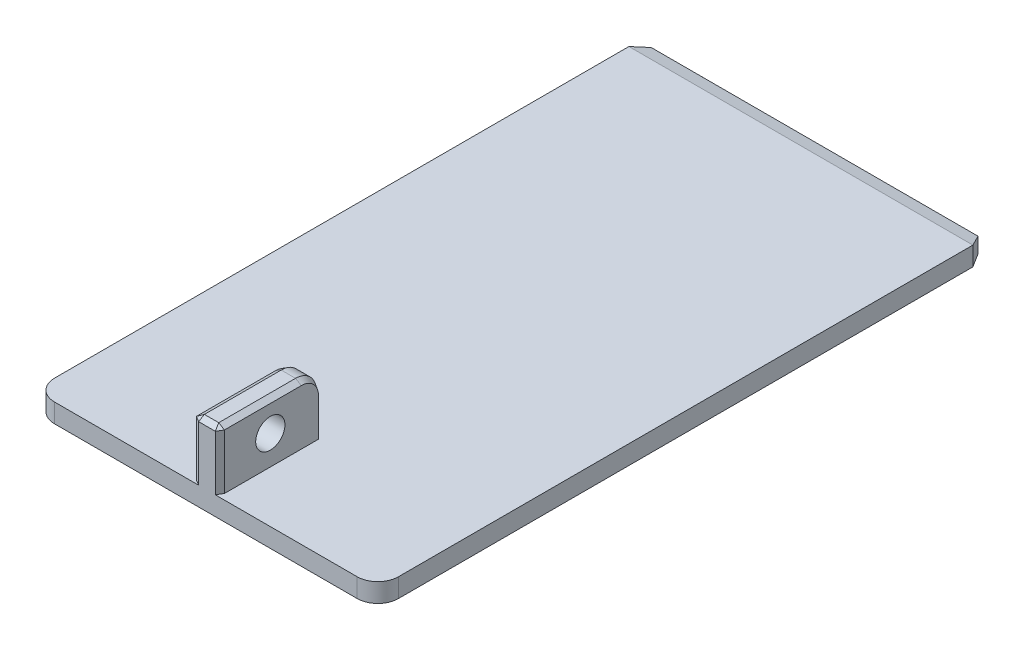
ISO-10303-21;
HEADER;
FILE_DESCRIPTION(('STEP AP214'),'2;1');
FILE_NAME('part.step','',(''),(''),'','','');
FILE_SCHEMA(('AUTOMOTIVE_DESIGN { 1 0 10303 214 1 1 1 1 }'));
ENDSEC;
DATA;
#1=APPLICATION_CONTEXT('core data for automotive mechanical design processes');
#2=APPLICATION_PROTOCOL_DEFINITION('international standard','automotive_design',2000,#1);
#3=PRODUCT_CONTEXT('',#1,'mechanical');
#4=PRODUCT('Part','Part','',(#3));
#5=PRODUCT_RELATED_PRODUCT_CATEGORY('part','',(#4));
#6=PRODUCT_DEFINITION_FORMATION('','',#4);
#7=PRODUCT_DEFINITION_CONTEXT('part definition',#1,'design');
#8=PRODUCT_DEFINITION('design','',#6,#7);
#9=PRODUCT_DEFINITION_SHAPE('','',#8);
#10=(LENGTH_UNIT() NAMED_UNIT(*) SI_UNIT(.MILLI.,.METRE.));
#11=(NAMED_UNIT(*) PLANE_ANGLE_UNIT() SI_UNIT($,.RADIAN.));
#12=(NAMED_UNIT(*) SI_UNIT($,.STERADIAN.) SOLID_ANGLE_UNIT());
#13=UNCERTAINTY_MEASURE_WITH_UNIT(LENGTH_MEASURE(1.E-05),#10,'distance_accuracy_value','');
#14=(GEOMETRIC_REPRESENTATION_CONTEXT(3) GLOBAL_UNCERTAINTY_ASSIGNED_CONTEXT((#13)) GLOBAL_UNIT_ASSIGNED_CONTEXT((#10,
#11,#12)) REPRESENTATION_CONTEXT('',''));
#15=CARTESIAN_POINT('',(0.,0.,0.));
#16=DIRECTION('',(0.,0.,1.));
#17=DIRECTION('',(1.,0.,0.));
#18=AXIS2_PLACEMENT_3D('',#15,#16,#17);
#19=CARTESIAN_POINT('',(-50.,2.75,177.));
#20=DIRECTION('',(0.,-1.,0.));
#21=DIRECTION('',(0.,0.,-1.));
#22=AXIS2_PLACEMENT_3D('',#19,#20,#21);
#23=PLANE('',#22);
#24=DIRECTION('',(0.,0.,-1.));
#25=VECTOR('',#24,1.);
#26=CARTESIAN_POINT('',(-50.,2.75,177.));
#27=LINE('',#26,#25);
#28=CARTESIAN_POINT('',(-50.,2.75,171.));
#29=VERTEX_POINT('',#28);
#30=CARTESIAN_POINT('',(-50.,2.75,4.));
#31=VERTEX_POINT('',#30);
#32=EDGE_CURVE('E179',#29,#31,#27,.T.);
#33=ORIENTED_EDGE('',*,*,#32,.F.);
#34=CARTESIAN_POINT('',(-44.,2.75,171.));
#35=DIRECTION('',(0.,-1.,0.));
#36=DIRECTION('',(0.,0.,-1.));
#37=AXIS2_PLACEMENT_3D('',#34,#35,#36);
#38=CIRCLE('',#37,6.);
#39=CARTESIAN_POINT('',(-44.,2.75,177.));
#40=VERTEX_POINT('',#39);
#41=EDGE_CURVE('E240',#29,#40,#38,.F.);
#42=ORIENTED_EDGE('',*,*,#41,.T.);
#43=DIRECTION('',(-1.,0.,0.));
#44=VECTOR('',#43,1.);
#45=CARTESIAN_POINT('',(-50.,2.75,177.));
#46=LINE('',#45,#44);
#47=CARTESIAN_POINT('',(-2.08572051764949,2.75,177.));
#48=VERTEX_POINT('',#47);
#49=EDGE_CURVE('E336',#48,#40,#46,.T.);
#50=ORIENTED_EDGE('',*,*,#49,.F.);
#51=DIRECTION('',(-0.857167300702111,0.,-0.515038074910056));
#52=VECTOR('',#51,1.);
#53=CARTESIAN_POINT('',(-37.2900560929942,2.75,155.847101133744));
#54=LINE('',#53,#52);
#55=CARTESIAN_POINT('',(-3.75,2.75,176.));
#56=VERTEX_POINT('',#55);
#57=EDGE_CURVE('E11',#48,#56,#54,.T.);
#58=ORIENTED_EDGE('',*,*,#57,.T.);
#59=DIRECTION('',(0.,0.,1.));
#60=VECTOR('',#59,1.);
#61=CARTESIAN_POINT('',(-3.75,2.75,177.));
#62=LINE('',#61,#60);
#63=CARTESIAN_POINT('',(-3.75,2.75,148.));
#64=VERTEX_POINT('',#63);
#65=EDGE_CURVE('E329',#64,#56,#62,.T.);
#66=ORIENTED_EDGE('',*,*,#65,.F.);
#67=DIRECTION('',(-0.857167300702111,0.,0.515038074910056));
#68=VECTOR('',#67,1.);
#69=CARTESIAN_POINT('',(-50.5342699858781,2.75,176.110825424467));
#70=LINE('',#69,#68);
#71=CARTESIAN_POINT('',(-2.08572051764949,2.75,147.));
#72=VERTEX_POINT('',#71);
#73=EDGE_CURVE('E282',#64,#72,#70,.F.);
#74=ORIENTED_EDGE('',*,*,#73,.T.);
#75=DIRECTION('',(-1.,0.,0.));
#76=VECTOR('',#75,1.);
#77=CARTESIAN_POINT('',(-3.75,2.75,147.));
#78=LINE('',#77,#76);
#79=CARTESIAN_POINT('',(2.08572051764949,2.75,147.));
#80=VERTEX_POINT('',#79);
#81=EDGE_CURVE('E326',#80,#72,#78,.T.);
#82=ORIENTED_EDGE('',*,*,#81,.F.);
#83=DIRECTION('',(-0.857167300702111,0.,-0.515038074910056));
#84=VECTOR('',#83,1.);
#85=CARTESIAN_POINT('',(-22.9393081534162,2.75,131.963445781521));
#86=LINE('',#85,#84);
#87=CARTESIAN_POINT('',(3.75,2.75,148.));
#88=VERTEX_POINT('',#87);
#89=EDGE_CURVE('E280',#80,#88,#86,.F.);
#90=ORIENTED_EDGE('',*,*,#89,.T.);
#91=DIRECTION('',(0.,0.,-1.));
#92=VECTOR('',#91,1.);
#93=CARTESIAN_POINT('',(3.75,2.75,177.));
#94=LINE('',#93,#92);
#95=CARTESIAN_POINT('',(3.75,2.75,175.335720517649));
#96=VERTEX_POINT('',#95);
#97=EDGE_CURVE('E221',#96,#88,#94,.T.);
#98=ORIENTED_EDGE('',*,*,#97,.F.);
#99=DIRECTION('',(-0.515038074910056,0.,0.857167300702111));
#100=VECTOR('',#99,1.);
#101=CARTESIAN_POINT('',(-11.2426875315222,2.75,200.287742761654));
#102=LINE('',#101,#100);
#103=CARTESIAN_POINT('',(2.75,2.75,177.));
#104=VERTEX_POINT('',#103);
#105=EDGE_CURVE('E46',#96,#104,#102,.T.);
#106=ORIENTED_EDGE('',*,*,#105,.T.);
#107=CARTESIAN_POINT('',(44.,2.75,177.));
#108=VERTEX_POINT('',#107);
#109=EDGE_CURVE('E333',#108,#104,#46,.T.);
#110=ORIENTED_EDGE('',*,*,#109,.F.);
#111=CARTESIAN_POINT('',(44.,2.75,171.));
#112=DIRECTION('',(0.,-1.,0.));
#113=DIRECTION('',(0.,0.,-1.));
#114=AXIS2_PLACEMENT_3D('',#111,#112,#113);
#115=CIRCLE('',#114,6.);
#116=CARTESIAN_POINT('',(50.,2.75,171.));
#117=VERTEX_POINT('',#116);
#118=EDGE_CURVE('E238',#108,#117,#115,.F.);
#119=ORIENTED_EDGE('',*,*,#118,.T.);
#120=DIRECTION('',(0.,0.,-1.));
#121=VECTOR('',#120,1.);
#122=CARTESIAN_POINT('',(50.,2.75,177.));
#123=LINE('',#122,#121);
#124=CARTESIAN_POINT('',(50.,2.75,4.));
#125=VERTEX_POINT('',#124);
#126=EDGE_CURVE('E195',#117,#125,#123,.T.);
#127=ORIENTED_EDGE('',*,*,#126,.T.);
#128=DIRECTION('',(-1.,0.,0.));
#129=VECTOR('',#128,1.);
#130=CARTESIAN_POINT('',(-50.,2.75,4.00000000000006));
#131=LINE('',#130,#129);
#132=EDGE_CURVE('E207',#125,#31,#131,.T.);
#133=ORIENTED_EDGE('',*,*,#132,.T.);
#134=EDGE_LOOP('',(#33,#42,#50,#58,#66,#74,#82,#90,#98,#106,#110,#119,#127,#133));
#135=FACE_BOUND('',#134,.T.);
#136=ADVANCED_FACE('F36',(#135),#23,.F.);
#137=CARTESIAN_POINT('',(50.,2.75,177.));
#138=DIRECTION('',(-1.,0.,0.));
#139=DIRECTION('',(0.,0.,1.));
#140=AXIS2_PLACEMENT_3D('',#137,#138,#139);
#141=PLANE('',#140);
#142=ORIENTED_EDGE('',*,*,#126,.F.);
#143=DIRECTION('',(0.,1.,0.));
#144=VECTOR('',#143,1.);
#145=CARTESIAN_POINT('',(50.,-2.75,171.));
#146=LINE('',#145,#144);
#147=CARTESIAN_POINT('',(50.,-2.75,171.));
#148=VERTEX_POINT('',#147);
#149=EDGE_CURVE('E242',#117,#148,#146,.F.);
#150=ORIENTED_EDGE('',*,*,#149,.T.);
#151=DIRECTION('',(0.,0.,-1.));
#152=VECTOR('',#151,1.);
#153=CARTESIAN_POINT('',(50.,-2.75,177.));
#154=LINE('',#153,#152);
#155=CARTESIAN_POINT('',(50.,-2.75,4.));
#156=VERTEX_POINT('',#155);
#157=EDGE_CURVE('E180',#148,#156,#154,.T.);
#158=ORIENTED_EDGE('',*,*,#157,.T.);
#159=DIRECTION('',(0.,1.,0.));
#160=VECTOR('',#159,1.);
#161=CARTESIAN_POINT('',(50.,2.75,4.));
#162=LINE('',#161,#160);
#163=EDGE_CURVE('E204',#156,#125,#162,.T.);
#164=ORIENTED_EDGE('',*,*,#163,.T.);
#165=EDGE_LOOP('',(#142,#150,#158,#164));
#166=FACE_BOUND('',#165,.T.);
#167=ADVANCED_FACE('F343',(#166),#141,.F.);
#168=CARTESIAN_POINT('',(-50.,2.75,177.));
#169=DIRECTION('',(1.,0.,0.));
#170=DIRECTION('',(0.,0.,-1.));
#171=AXIS2_PLACEMENT_3D('',#168,#169,#170);
#172=PLANE('',#171);
#173=DIRECTION('',(0.,0.,-1.));
#174=VECTOR('',#173,1.);
#175=CARTESIAN_POINT('',(-50.,-2.75,177.));
#176=LINE('',#175,#174);
#177=CARTESIAN_POINT('',(-50.,-2.75,171.));
#178=VERTEX_POINT('',#177);
#179=CARTESIAN_POINT('',(-50.,-2.75,4.));
#180=VERTEX_POINT('',#179);
#181=EDGE_CURVE('E168',#178,#180,#176,.T.);
#182=ORIENTED_EDGE('',*,*,#181,.F.);
#183=DIRECTION('',(0.,-1.,0.));
#184=VECTOR('',#183,1.);
#185=CARTESIAN_POINT('',(-50.,2.75,171.));
#186=LINE('',#185,#184);
#187=EDGE_CURVE('E236',#178,#29,#186,.F.);
#188=ORIENTED_EDGE('',*,*,#187,.T.);
#189=ORIENTED_EDGE('',*,*,#32,.T.);
#190=DIRECTION('',(0.,-1.,0.));
#191=VECTOR('',#190,1.);
#192=CARTESIAN_POINT('',(-50.,2.75,4.));
#193=LINE('',#192,#191);
#194=EDGE_CURVE('E186',#31,#180,#193,.T.);
#195=ORIENTED_EDGE('',*,*,#194,.T.);
#196=EDGE_LOOP('',(#182,#188,#189,#195));
#197=FACE_BOUND('',#196,.T.);
#198=ADVANCED_FACE('F192',(#197),#172,.F.);
#199=CARTESIAN_POINT('',(-50.,-2.75,177.));
#200=DIRECTION('',(0.,1.,0.));
#201=DIRECTION('',(0.,0.,1.));
#202=AXIS2_PLACEMENT_3D('',#199,#200,#201);
#203=PLANE('',#202);
#204=DIRECTION('',(1.,0.,0.));
#205=VECTOR('',#204,1.);
#206=CARTESIAN_POINT('',(-50.,-2.75,177.));
#207=LINE('',#206,#205);
#208=CARTESIAN_POINT('',(-44.,-2.75,177.));
#209=VERTEX_POINT('',#208);
#210=CARTESIAN_POINT('',(44.,-2.75,177.));
#211=VERTEX_POINT('',#210);
#212=EDGE_CURVE('E335',#209,#211,#207,.T.);
#213=ORIENTED_EDGE('',*,*,#212,.F.);
#214=CARTESIAN_POINT('',(-44.,-2.75,171.));
#215=DIRECTION('',(0.,1.,0.));
#216=DIRECTION('',(0.,0.,1.));
#217=AXIS2_PLACEMENT_3D('',#214,#215,#216);
#218=CIRCLE('',#217,6.);
#219=EDGE_CURVE('E175',#209,#178,#218,.F.);
#220=ORIENTED_EDGE('',*,*,#219,.T.);
#221=ORIENTED_EDGE('',*,*,#181,.T.);
#222=DIRECTION('',(-0.52999894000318,0.,0.847998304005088));
#223=VECTOR('',#222,1.);
#224=CARTESIAN_POINT('',(-50.,-2.75,4.));
#225=LINE('',#224,#223);
#226=CARTESIAN_POINT('',(-47.5,-2.75,0.));
#227=VERTEX_POINT('',#226);
#228=EDGE_CURVE('E173',#180,#227,#225,.F.);
#229=ORIENTED_EDGE('',*,*,#228,.T.);
#230=DIRECTION('',(1.,0.,0.));
#231=VECTOR('',#230,1.);
#232=CARTESIAN_POINT('',(-50.,-2.75,0.));
#233=LINE('',#232,#231);
#234=CARTESIAN_POINT('',(47.5,-2.75,0.));
#235=VERTEX_POINT('',#234);
#236=EDGE_CURVE('E332',#227,#235,#233,.T.);
#237=ORIENTED_EDGE('',*,*,#236,.T.);
#238=DIRECTION('',(-0.52999894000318,0.,-0.847998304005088));
#239=VECTOR('',#238,1.);
#240=CARTESIAN_POINT('',(50.,-2.75,4.));
#241=LINE('',#240,#239);
#242=EDGE_CURVE('E190',#235,#156,#241,.F.);
#243=ORIENTED_EDGE('',*,*,#242,.T.);
#244=ORIENTED_EDGE('',*,*,#157,.F.);
#245=CARTESIAN_POINT('',(44.,-2.75,171.));
#246=DIRECTION('',(0.,1.,0.));
#247=DIRECTION('',(0.,0.,1.));
#248=AXIS2_PLACEMENT_3D('',#245,#246,#247);
#249=CIRCLE('',#248,6.);
#250=EDGE_CURVE('E233',#148,#211,#249,.F.);
#251=ORIENTED_EDGE('',*,*,#250,.T.);
#252=EDGE_LOOP('',(#213,#220,#221,#229,#237,#243,#244,#251));
#253=FACE_BOUND('',#252,.T.);
#254=ADVANCED_FACE('F171',(#253),#203,.F.);
#255=CARTESIAN_POINT('',(0.,0.,177.));
#256=DIRECTION('',(0.,0.,1.));
#257=DIRECTION('',(1.,0.,0.));
#258=AXIS2_PLACEMENT_3D('',#255,#256,#257);
#259=PLANE('',#258);
#260=DIRECTION('',(0.,-1.,0.));
#261=VECTOR('',#260,1.);
#262=CARTESIAN_POINT('',(-2.08572051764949,2.75,177.));
#263=LINE('',#262,#261);
#264=CARTESIAN_POINT('',(-2.08572051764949,18.75,177.));
#265=VERTEX_POINT('',#264);
#266=EDGE_CURVE('E271',#265,#48,#263,.T.);
#267=ORIENTED_EDGE('',*,*,#266,.T.);
#268=ORIENTED_EDGE('',*,*,#49,.T.);
#269=DIRECTION('',(0.,-1.,0.));
#270=VECTOR('',#269,1.);
#271=CARTESIAN_POINT('',(-44.,-2.75,177.));
#272=LINE('',#271,#270);
#273=EDGE_CURVE('E230',#40,#209,#272,.T.);
#274=ORIENTED_EDGE('',*,*,#273,.T.);
#275=ORIENTED_EDGE('',*,*,#212,.T.);
#276=DIRECTION('',(0.,1.,0.));
#277=VECTOR('',#276,1.);
#278=CARTESIAN_POINT('',(44.,2.75,177.));
#279=LINE('',#278,#277);
#280=EDGE_CURVE('E227',#211,#108,#279,.T.);
#281=ORIENTED_EDGE('',*,*,#280,.T.);
#282=ORIENTED_EDGE('',*,*,#109,.T.);
#283=DIRECTION('',(0.,1.,0.));
#284=VECTOR('',#283,1.);
#285=CARTESIAN_POINT('',(2.75,19.75,177.));
#286=LINE('',#285,#284);
#287=CARTESIAN_POINT('',(2.75,18.75,177.));
#288=VERTEX_POINT('',#287);
#289=EDGE_CURVE('E274',#104,#288,#286,.T.);
#290=ORIENTED_EDGE('',*,*,#289,.T.);
#291=DIRECTION('',(-1.,0.,0.));
#292=VECTOR('',#291,1.);
#293=CARTESIAN_POINT('',(-3.75,18.75,177.));
#294=LINE('',#293,#292);
#295=EDGE_CURVE('E269',#288,#265,#294,.T.);
#296=ORIENTED_EDGE('',*,*,#295,.T.);
#297=EDGE_LOOP('',(#267,#268,#274,#275,#281,#282,#290,#296));
#298=FACE_BOUND('',#297,.T.);
#299=ADVANCED_FACE('F363',(#298),#259,.T.);
#300=CARTESIAN_POINT('',(0.,0.,0.));
#301=DIRECTION('',(0.,0.,1.));
#302=DIRECTION('',(1.,0.,0.));
#303=AXIS2_PLACEMENT_3D('',#300,#301,#302);
#304=PLANE('',#303);
#305=DIRECTION('',(0.,1.,0.));
#306=VECTOR('',#305,1.);
#307=CARTESIAN_POINT('',(-47.5,0.,0.));
#308=LINE('',#307,#306);
#309=CARTESIAN_POINT('',(-47.5,1.75,0.));
#310=VERTEX_POINT('',#309);
#311=EDGE_CURVE('E188',#227,#310,#308,.T.);
#312=ORIENTED_EDGE('',*,*,#311,.T.);
#313=DIRECTION('',(1.,0.,0.));
#314=VECTOR('',#313,1.);
#315=CARTESIAN_POINT('',(0.,1.75,0.));
#316=LINE('',#315,#314);
#317=CARTESIAN_POINT('',(47.5,1.75,0.));
#318=VERTEX_POINT('',#317);
#319=EDGE_CURVE('E212',#310,#318,#316,.T.);
#320=ORIENTED_EDGE('',*,*,#319,.T.);
#321=DIRECTION('',(0.,-1.,0.));
#322=VECTOR('',#321,1.);
#323=CARTESIAN_POINT('',(47.5,0.,0.));
#324=LINE('',#323,#322);
#325=EDGE_CURVE('E189',#318,#235,#324,.T.);
#326=ORIENTED_EDGE('',*,*,#325,.T.);
#327=ORIENTED_EDGE('',*,*,#236,.F.);
#328=EDGE_LOOP('',(#312,#320,#326,#327));
#329=FACE_BOUND('',#328,.T.);
#330=ADVANCED_FACE('F446',(#329),#304,.F.);
#331=CARTESIAN_POINT('',(-50.,2.75,4.));
#332=DIRECTION('',(0.847998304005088,0.,0.52999894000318));
#333=DIRECTION('',(0.,-1.,0.));
#334=AXIS2_PLACEMENT_3D('',#331,#332,#333);
#335=PLANE('',#334);
#336=ORIENTED_EDGE('',*,*,#194,.F.);
#337=DIRECTION('',(0.518475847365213,-0.207390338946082,-0.829561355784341));
#338=VECTOR('',#337,1.);
#339=CARTESIAN_POINT('',(-50.,2.75,4.));
#340=LINE('',#339,#338);
#341=EDGE_CURVE('E210',#31,#310,#340,.T.);
#342=ORIENTED_EDGE('',*,*,#341,.T.);
#343=ORIENTED_EDGE('',*,*,#311,.F.);
#344=ORIENTED_EDGE('',*,*,#228,.F.);
#345=EDGE_LOOP('',(#336,#342,#343,#344));
#346=FACE_BOUND('',#345,.T.);
#347=ADVANCED_FACE('F185',(#346),#335,.F.);
#348=CARTESIAN_POINT('',(50.,2.75,4.));
#349=DIRECTION('',(-0.847998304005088,0.,0.52999894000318));
#350=DIRECTION('',(0.,1.,0.));
#351=AXIS2_PLACEMENT_3D('',#348,#349,#350);
#352=PLANE('',#351);
#353=ORIENTED_EDGE('',*,*,#325,.F.);
#354=DIRECTION('',(0.518475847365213,0.207390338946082,0.829561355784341));
#355=VECTOR('',#354,1.);
#356=CARTESIAN_POINT('',(50.,2.75,4.));
#357=LINE('',#356,#355);
#358=EDGE_CURVE('E214',#318,#125,#357,.T.);
#359=ORIENTED_EDGE('',*,*,#358,.T.);
#360=ORIENTED_EDGE('',*,*,#163,.F.);
#361=ORIENTED_EDGE('',*,*,#242,.F.);
#362=EDGE_LOOP('',(#353,#359,#360,#361));
#363=FACE_BOUND('',#362,.T.);
#364=ADVANCED_FACE('F351',(#363),#352,.F.);
#365=CARTESIAN_POINT('',(-50.,2.75,4.00000000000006));
#366=DIRECTION('',(0.,-0.970142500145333,0.24253562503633));
#367=DIRECTION('',(-1.,0.,0.));
#368=AXIS2_PLACEMENT_3D('',#365,#366,#367);
#369=PLANE('',#368);
#370=ORIENTED_EDGE('',*,*,#358,.F.);
#371=ORIENTED_EDGE('',*,*,#319,.F.);
#372=ORIENTED_EDGE('',*,*,#341,.F.);
#373=ORIENTED_EDGE('',*,*,#132,.F.);
#374=EDGE_LOOP('',(#370,#371,#372,#373));
#375=FACE_BOUND('',#374,.T.);
#376=ADVANCED_FACE('F355',(#375),#369,.F.);
#377=CARTESIAN_POINT('',(3.75,19.75,177.));
#378=DIRECTION('',(-1.,0.,0.));
#379=DIRECTION('',(0.,0.,1.));
#380=AXIS2_PLACEMENT_3D('',#377,#378,#379);
#381=PLANE('',#380);
#382=ORIENTED_EDGE('',*,*,#97,.T.);
#383=DIRECTION('',(0.,1.,0.));
#384=VECTOR('',#383,1.);
#385=CARTESIAN_POINT('',(3.75,19.75,148.));
#386=LINE('',#385,#384);
#387=CARTESIAN_POINT('',(3.75,13.75,148.));
#388=VERTEX_POINT('',#387);
#389=EDGE_CURVE('E255',#88,#388,#386,.T.);
#390=ORIENTED_EDGE('',*,*,#389,.T.);
#391=CARTESIAN_POINT('',(3.75,13.75,153.));
#392=DIRECTION('',(-1.,0.,0.));
#393=DIRECTION('',(0.,0.,1.));
#394=AXIS2_PLACEMENT_3D('',#391,#392,#393);
#395=CIRCLE('',#394,5.);
#396=CARTESIAN_POINT('',(3.75,18.75,153.));
#397=VERTEX_POINT('',#396);
#398=EDGE_CURVE('E253',#388,#397,#395,.F.);
#399=ORIENTED_EDGE('',*,*,#398,.T.);
#400=DIRECTION('',(0.,0.,1.));
#401=VECTOR('',#400,1.);
#402=CARTESIAN_POINT('',(3.75,18.75,177.));
#403=LINE('',#402,#401);
#404=CARTESIAN_POINT('',(3.75,18.75,175.335720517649));
#405=VERTEX_POINT('',#404);
#406=EDGE_CURVE('E249',#397,#405,#403,.T.);
#407=ORIENTED_EDGE('',*,*,#406,.T.);
#408=DIRECTION('',(0.,-1.,0.));
#409=VECTOR('',#408,1.);
#410=CARTESIAN_POINT('',(3.75,2.75,175.335720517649));
#411=LINE('',#410,#409);
#412=EDGE_CURVE('E251',#405,#96,#411,.T.);
#413=ORIENTED_EDGE('',*,*,#412,.T.);
#414=EDGE_LOOP('',(#382,#390,#399,#407,#413));
#415=FACE_BOUND('',#414,.T.);
#416=CARTESIAN_POINT('',(3.74999999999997,11.25,162.));
#417=DIRECTION('',(1.,0.,0.));
#418=DIRECTION('',(0.,0.,-1.));
#419=AXIS2_PLACEMENT_3D('',#416,#417,#418);
#420=CIRCLE('',#419,4.25000000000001);
#421=CARTESIAN_POINT('',(3.74999999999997,11.25,157.75));
#422=VERTEX_POINT('',#421);
#423=EDGE_CURVE('E222',#422,#422,#420,.T.);
#424=ORIENTED_EDGE('',*,*,#423,.F.);
#425=EDGE_LOOP('',(#424));
#426=FACE_BOUND('',#425,.T.);
#427=ADVANCED_FACE('F415',(#415,#426),#381,.F.);
#428=CARTESIAN_POINT('',(-3.75,19.75,147.));
#429=DIRECTION('',(0.,0.,1.));
#430=DIRECTION('',(1.,0.,0.));
#431=AXIS2_PLACEMENT_3D('',#428,#429,#430);
#432=PLANE('',#431);
#433=DIRECTION('',(-1.,0.,0.));
#434=VECTOR('',#433,1.);
#435=CARTESIAN_POINT('',(-3.75,13.75,147.));
#436=LINE('',#435,#434);
#437=CARTESIAN_POINT('',(-2.08572051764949,13.75,147.));
#438=VERTEX_POINT('',#437);
#439=CARTESIAN_POINT('',(2.08572051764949,13.75,147.));
#440=VERTEX_POINT('',#439);
#441=EDGE_CURVE('E224',#438,#440,#436,.F.);
#442=ORIENTED_EDGE('',*,*,#441,.T.);
#443=DIRECTION('',(0.,-1.,0.));
#444=VECTOR('',#443,1.);
#445=CARTESIAN_POINT('',(2.08572051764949,19.75,147.));
#446=LINE('',#445,#444);
#447=EDGE_CURVE('E246',#440,#80,#446,.T.);
#448=ORIENTED_EDGE('',*,*,#447,.T.);
#449=ORIENTED_EDGE('',*,*,#81,.T.);
#450=DIRECTION('',(0.,1.,0.));
#451=VECTOR('',#450,1.);
#452=CARTESIAN_POINT('',(-2.08572051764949,19.75,147.));
#453=LINE('',#452,#451);
#454=EDGE_CURVE('E244',#72,#438,#453,.T.);
#455=ORIENTED_EDGE('',*,*,#454,.T.);
#456=EDGE_LOOP('',(#442,#448,#449,#455));
#457=FACE_BOUND('',#456,.T.);
#458=ADVANCED_FACE('F406',(#457),#432,.F.);
#459=CARTESIAN_POINT('',(-3.75,19.75,177.));
#460=DIRECTION('',(1.,0.,0.));
#461=DIRECTION('',(0.,0.,-1.));
#462=AXIS2_PLACEMENT_3D('',#459,#460,#461);
#463=PLANE('',#462);
#464=CARTESIAN_POINT('',(-3.75,11.25,162.));
#465=DIRECTION('',(1.,0.,0.));
#466=DIRECTION('',(0.,0.,-1.));
#467=AXIS2_PLACEMENT_3D('',#464,#465,#466);
#468=CIRCLE('',#467,4.25000000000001);
#469=CARTESIAN_POINT('',(-3.75,11.25,157.75));
#470=VERTEX_POINT('',#469);
#471=EDGE_CURVE('E218',#470,#470,#468,.T.);
#472=ORIENTED_EDGE('',*,*,#471,.T.);
#473=EDGE_LOOP('',(#472));
#474=FACE_BOUND('',#473,.T.);
#475=CARTESIAN_POINT('',(-3.75,13.75,153.));
#476=DIRECTION('',(1.,0.,0.));
#477=DIRECTION('',(0.,0.,-1.));
#478=AXIS2_PLACEMENT_3D('',#475,#476,#477);
#479=CIRCLE('',#478,5.);
#480=CARTESIAN_POINT('',(-3.75,18.75,153.));
#481=VERTEX_POINT('',#480);
#482=CARTESIAN_POINT('',(-3.75,13.75,148.));
#483=VERTEX_POINT('',#482);
#484=EDGE_CURVE('E261',#481,#483,#479,.F.);
#485=ORIENTED_EDGE('',*,*,#484,.T.);
#486=DIRECTION('',(0.,-1.,0.));
#487=VECTOR('',#486,1.);
#488=CARTESIAN_POINT('',(-3.75,19.75,148.));
#489=LINE('',#488,#487);
#490=EDGE_CURVE('E263',#483,#64,#489,.T.);
#491=ORIENTED_EDGE('',*,*,#490,.T.);
#492=ORIENTED_EDGE('',*,*,#65,.T.);
#493=DIRECTION('',(0.,1.,0.));
#494=VECTOR('',#493,1.);
#495=CARTESIAN_POINT('',(-3.75,19.75,176.));
#496=LINE('',#495,#494);
#497=CARTESIAN_POINT('',(-3.75,18.75,176.));
#498=VERTEX_POINT('',#497);
#499=EDGE_CURVE('E259',#56,#498,#496,.T.);
#500=ORIENTED_EDGE('',*,*,#499,.T.);
#501=DIRECTION('',(0.,0.,-1.));
#502=VECTOR('',#501,1.);
#503=CARTESIAN_POINT('',(-3.75,18.75,177.));
#504=LINE('',#503,#502);
#505=EDGE_CURVE('E257',#498,#481,#504,.T.);
#506=ORIENTED_EDGE('',*,*,#505,.T.);
#507=EDGE_LOOP('',(#485,#491,#492,#500,#506));
#508=FACE_BOUND('',#507,.T.);
#509=ADVANCED_FACE('F377',(#474,#508),#463,.F.);
#510=CARTESIAN_POINT('',(0.,19.75,0.));
#511=DIRECTION('',(0.,-1.,0.));
#512=DIRECTION('',(0.,0.,-1.));
#513=AXIS2_PLACEMENT_3D('',#510,#511,#512);
#514=PLANE('',#513);
#515=DIRECTION('',(1.,0.,0.));
#516=VECTOR('',#515,1.);
#517=CARTESIAN_POINT('',(3.75,19.75,175.335720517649));
#518=LINE('',#517,#516);
#519=CARTESIAN_POINT('',(-2.08572051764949,19.75,175.335720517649));
#520=VERTEX_POINT('',#519);
#521=CARTESIAN_POINT('',(2.08572051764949,19.75,175.335720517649));
#522=VERTEX_POINT('',#521);
#523=EDGE_CURVE('E54',#520,#522,#518,.T.);
#524=ORIENTED_EDGE('',*,*,#523,.T.);
#525=DIRECTION('',(0.,0.,-1.));
#526=VECTOR('',#525,1.);
#527=CARTESIAN_POINT('',(2.08572051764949,19.75,0.));
#528=LINE('',#527,#526);
#529=CARTESIAN_POINT('',(2.08572051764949,19.75,153.));
#530=VERTEX_POINT('',#529);
#531=EDGE_CURVE('E278',#522,#530,#528,.T.);
#532=ORIENTED_EDGE('',*,*,#531,.T.);
#533=DIRECTION('',(-1.,0.,0.));
#534=VECTOR('',#533,1.);
#535=CARTESIAN_POINT('',(0.,19.75,153.));
#536=LINE('',#535,#534);
#537=CARTESIAN_POINT('',(-2.08572051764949,19.75,153.));
#538=VERTEX_POINT('',#537);
#539=EDGE_CURVE('E217',#530,#538,#536,.T.);
#540=ORIENTED_EDGE('',*,*,#539,.T.);
#541=DIRECTION('',(0.,0.,1.));
#542=VECTOR('',#541,1.);
#543=CARTESIAN_POINT('',(-2.08572051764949,19.75,0.));
#544=LINE('',#543,#542);
#545=EDGE_CURVE('E59',#538,#520,#544,.T.);
#546=ORIENTED_EDGE('',*,*,#545,.T.);
#547=EDGE_LOOP('',(#524,#532,#540,#546));
#548=FACE_BOUND('',#547,.T.);
#549=ADVANCED_FACE('F395',(#548),#514,.F.);
#550=CARTESIAN_POINT('',(-50.,11.25,162.));
#551=DIRECTION('',(1.,0.,0.));
#552=DIRECTION('',(0.,0.,-1.));
#553=AXIS2_PLACEMENT_3D('',#550,#551,#552);
#554=CYLINDRICAL_SURFACE('',#553,4.25000000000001);
#555=ORIENTED_EDGE('',*,*,#423,.T.);
#556=EDGE_LOOP('',(#555));
#557=FACE_BOUND('',#556,.T.);
#558=ORIENTED_EDGE('',*,*,#471,.F.);
#559=EDGE_LOOP('',(#558));
#560=FACE_BOUND('',#559,.T.);
#561=ADVANCED_FACE('F458',(#557,#560),#554,.F.);
#562=CARTESIAN_POINT('',(0.,13.75,153.));
#563=DIRECTION('',(-1.,0.,0.));
#564=DIRECTION('',(0.,0.,1.));
#565=AXIS2_PLACEMENT_3D('',#562,#563,#564);
#566=CYLINDRICAL_SURFACE('',#565,6.);
#567=ORIENTED_EDGE('',*,*,#539,.F.);
#568=CARTESIAN_POINT('',(2.08572051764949,13.75,153.));
#569=DIRECTION('',(-1.,0.,0.));
#570=DIRECTION('',(0.,0.,1.));
#571=AXIS2_PLACEMENT_3D('',#568,#569,#570);
#572=CIRCLE('',#571,6.);
#573=EDGE_CURVE('E267',#530,#440,#572,.T.);
#574=ORIENTED_EDGE('',*,*,#573,.T.);
#575=ORIENTED_EDGE('',*,*,#441,.F.);
#576=CARTESIAN_POINT('',(-2.08572051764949,13.75,153.));
#577=DIRECTION('',(1.,0.,0.));
#578=DIRECTION('',(0.,0.,-1.));
#579=AXIS2_PLACEMENT_3D('',#576,#577,#578);
#580=CIRCLE('',#579,6.);
#581=EDGE_CURVE('E265',#438,#538,#580,.T.);
#582=ORIENTED_EDGE('',*,*,#581,.T.);
#583=EDGE_LOOP('',(#567,#574,#575,#582));
#584=FACE_BOUND('',#583,.T.);
#585=ADVANCED_FACE('F397',(#584),#566,.T.);
#586=CARTESIAN_POINT('',(-44.,0.,171.));
#587=DIRECTION('',(0.,1.,0.));
#588=DIRECTION('',(0.,0.,1.));
#589=AXIS2_PLACEMENT_3D('',#586,#587,#588);
#590=CYLINDRICAL_SURFACE('',#589,6.);
#591=ORIENTED_EDGE('',*,*,#41,.F.);
#592=ORIENTED_EDGE('',*,*,#187,.F.);
#593=ORIENTED_EDGE('',*,*,#219,.F.);
#594=ORIENTED_EDGE('',*,*,#273,.F.);
#595=EDGE_LOOP('',(#591,#592,#593,#594));
#596=FACE_BOUND('',#595,.T.);
#597=ADVANCED_FACE('F367',(#596),#590,.T.);
#598=CARTESIAN_POINT('',(44.,0.,171.));
#599=DIRECTION('',(0.,-1.,0.));
#600=DIRECTION('',(0.,0.,-1.));
#601=AXIS2_PLACEMENT_3D('',#598,#599,#600);
#602=CYLINDRICAL_SURFACE('',#601,6.);
#603=ORIENTED_EDGE('',*,*,#250,.F.);
#604=ORIENTED_EDGE('',*,*,#149,.F.);
#605=ORIENTED_EDGE('',*,*,#118,.F.);
#606=ORIENTED_EDGE('',*,*,#280,.F.);
#607=EDGE_LOOP('',(#603,#604,#605,#606));
#608=FACE_BOUND('',#607,.T.);
#609=ADVANCED_FACE('F360',(#608),#602,.T.);
#610=CARTESIAN_POINT('',(-3.75,19.75,148.));
#611=DIRECTION('',(0.515038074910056,0.,0.857167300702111));
#612=DIRECTION('',(0.,-1.,0.));
#613=AXIS2_PLACEMENT_3D('',#610,#611,#612);
#614=PLANE('',#613);
#615=ORIENTED_EDGE('',*,*,#73,.F.);
#616=ORIENTED_EDGE('',*,*,#490,.F.);
#617=DIRECTION('',(-0.857167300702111,0.,0.515038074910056));
#618=VECTOR('',#617,1.);
#619=CARTESIAN_POINT('',(-2.08572051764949,13.75,147.));
#620=LINE('',#619,#618);
#621=EDGE_CURVE('E41',#438,#483,#620,.T.);
#622=ORIENTED_EDGE('',*,*,#621,.F.);
#623=ORIENTED_EDGE('',*,*,#454,.F.);
#624=EDGE_LOOP('',(#615,#616,#622,#623));
#625=FACE_BOUND('',#624,.T.);
#626=ADVANCED_FACE('F39',(#625),#614,.F.);
#627=CARTESIAN_POINT('',(-3.75,13.75,153.));
#628=DIRECTION('',(1.,0.,0.));
#629=DIRECTION('',(0.,0.,-1.));
#630=AXIS2_PLACEMENT_3D('',#627,#628,#629);
#631=CONICAL_SURFACE('',#630,5.,0.541052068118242);
#632=ORIENTED_EDGE('',*,*,#621,.T.);
#633=ORIENTED_EDGE('',*,*,#484,.F.);
#634=DIRECTION('',(-0.857167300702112,-0.515038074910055,0.));
#635=VECTOR('',#634,1.);
#636=CARTESIAN_POINT('',(-2.08572051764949,19.75,153.));
#637=LINE('',#636,#635);
#638=EDGE_CURVE('E309',#538,#481,#637,.T.);
#639=ORIENTED_EDGE('',*,*,#638,.F.);
#640=ORIENTED_EDGE('',*,*,#581,.F.);
#641=EDGE_LOOP('',(#632,#633,#639,#640));
#642=FACE_BOUND('',#641,.T.);
#643=ADVANCED_FACE('F399',(#642),#631,.T.);
#644=CARTESIAN_POINT('',(-2.08572051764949,0.,177.));
#645=DIRECTION('',(-0.515038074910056,0.,0.857167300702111));
#646=DIRECTION('',(0.,1.,0.));
#647=AXIS2_PLACEMENT_3D('',#644,#645,#646);
#648=PLANE('',#647);
#649=ORIENTED_EDGE('',*,*,#57,.F.);
#650=ORIENTED_EDGE('',*,*,#266,.F.);
#651=DIRECTION('',(0.857167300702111,0.,0.515038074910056));
#652=VECTOR('',#651,1.);
#653=CARTESIAN_POINT('',(-3.75,18.75,176.));
#654=LINE('',#653,#652);
#655=EDGE_CURVE('E307',#498,#265,#654,.T.);
#656=ORIENTED_EDGE('',*,*,#655,.F.);
#657=ORIENTED_EDGE('',*,*,#499,.F.);
#658=EDGE_LOOP('',(#649,#650,#656,#657));
#659=FACE_BOUND('',#658,.T.);
#660=ADVANCED_FACE('F375',(#659),#648,.T.);
#661=CARTESIAN_POINT('',(-2.08572051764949,19.75,0.));
#662=DIRECTION('',(0.515038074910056,-0.857167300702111,0.));
#663=DIRECTION('',(0.,0.,1.));
#664=AXIS2_PLACEMENT_3D('',#661,#662,#663);
#665=PLANE('',#664);
#666=ORIENTED_EDGE('',*,*,#638,.T.);
#667=ORIENTED_EDGE('',*,*,#505,.F.);
#668=DIRECTION('',(0.811014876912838,0.487306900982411,-0.323707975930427));
#669=VECTOR('',#668,1.);
#670=CARTESIAN_POINT('',(-3.75,18.75,176.));
#671=LINE('',#670,#669);
#672=EDGE_CURVE('E304',#520,#498,#671,.F.);
#673=ORIENTED_EDGE('',*,*,#672,.F.);
#674=ORIENTED_EDGE('',*,*,#545,.F.);
#675=EDGE_LOOP('',(#666,#667,#673,#674));
#676=FACE_BOUND('',#675,.T.);
#677=ADVANCED_FACE('F378',(#676),#665,.F.);
#678=CARTESIAN_POINT('',(-3.75,18.75,176.));
#679=DIRECTION('',(-0.295633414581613,0.818853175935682,0.4920166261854));
#680=DIRECTION('',(0.,-0.515038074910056,0.857167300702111));
#681=AXIS2_PLACEMENT_3D('',#678,#679,#680);
#682=PLANE('',#681);
#683=ORIENTED_EDGE('',*,*,#672,.T.);
#684=ORIENTED_EDGE('',*,*,#655,.T.);
#685=DIRECTION('',(0.,0.515038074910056,-0.857167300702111));
#686=VECTOR('',#685,1.);
#687=CARTESIAN_POINT('',(-2.08572051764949,19.1914737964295,176.265264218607));
#688=LINE('',#687,#686);
#689=EDGE_CURVE('E301',#520,#265,#688,.F.);
#690=ORIENTED_EDGE('',*,*,#689,.F.);
#691=EDGE_LOOP('',(#683,#684,#690));
#692=FACE_BOUND('',#691,.T.);
#693=ADVANCED_FACE('F381',(#692),#682,.T.);
#694=CARTESIAN_POINT('',(3.75,19.75,175.335720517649));
#695=DIRECTION('',(0.857167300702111,0.,0.515038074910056));
#696=DIRECTION('',(0.,1.,0.));
#697=AXIS2_PLACEMENT_3D('',#694,#695,#696);
#698=PLANE('',#697);
#699=ORIENTED_EDGE('',*,*,#105,.F.);
#700=ORIENTED_EDGE('',*,*,#412,.F.);
#701=DIRECTION('',(0.515038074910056,0.,-0.857167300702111));
#702=VECTOR('',#701,1.);
#703=CARTESIAN_POINT('',(2.75,18.75,177.));
#704=LINE('',#703,#702);
#705=EDGE_CURVE('E298',#288,#405,#704,.T.);
#706=ORIENTED_EDGE('',*,*,#705,.F.);
#707=ORIENTED_EDGE('',*,*,#289,.F.);
#708=EDGE_LOOP('',(#699,#700,#706,#707));
#709=FACE_BOUND('',#708,.T.);
#710=ADVANCED_FACE('F420',(#709),#698,.T.);
#711=CARTESIAN_POINT('',(0.,19.75,175.335720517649));
#712=DIRECTION('',(0.,0.857167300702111,0.515038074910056));
#713=DIRECTION('',(-1.,0.,0.));
#714=AXIS2_PLACEMENT_3D('',#711,#712,#713);
#715=PLANE('',#714);
#716=ORIENTED_EDGE('',*,*,#689,.T.);
#717=ORIENTED_EDGE('',*,*,#295,.F.);
#718=DIRECTION('',(0.323707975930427,-0.487306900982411,0.811014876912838));
#719=VECTOR('',#718,1.);
#720=CARTESIAN_POINT('',(2.75,18.75,177.));
#721=LINE('',#720,#719);
#722=EDGE_CURVE('E295',#522,#288,#721,.T.);
#723=ORIENTED_EDGE('',*,*,#722,.F.);
#724=ORIENTED_EDGE('',*,*,#523,.F.);
#725=EDGE_LOOP('',(#716,#717,#723,#724));
#726=FACE_BOUND('',#725,.T.);
#727=ADVANCED_FACE('F383',(#726),#715,.T.);
#728=CARTESIAN_POINT('',(2.75,18.75,177.));
#729=DIRECTION('',(0.4920166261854,0.818853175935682,0.295633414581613));
#730=DIRECTION('',(-0.857167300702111,0.515038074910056,0.));
#731=AXIS2_PLACEMENT_3D('',#728,#729,#730);
#732=PLANE('',#731);
#733=ORIENTED_EDGE('',*,*,#722,.T.);
#734=ORIENTED_EDGE('',*,*,#705,.T.);
#735=DIRECTION('',(0.857167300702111,-0.515038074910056,0.));
#736=VECTOR('',#735,1.);
#737=CARTESIAN_POINT('',(3.01526421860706,19.1914737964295,175.335720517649));
#738=LINE('',#737,#736);
#739=EDGE_CURVE('E292',#522,#405,#738,.T.);
#740=ORIENTED_EDGE('',*,*,#739,.F.);
#741=EDGE_LOOP('',(#733,#734,#740));
#742=FACE_BOUND('',#741,.T.);
#743=ADVANCED_FACE('F388',(#742),#732,.T.);
#744=CARTESIAN_POINT('',(2.08572051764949,19.75,0.));
#745=DIRECTION('',(-0.515038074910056,-0.857167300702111,0.));
#746=DIRECTION('',(0.,0.,-1.));
#747=AXIS2_PLACEMENT_3D('',#744,#745,#746);
#748=PLANE('',#747);
#749=ORIENTED_EDGE('',*,*,#739,.T.);
#750=ORIENTED_EDGE('',*,*,#406,.F.);
#751=DIRECTION('',(0.857167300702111,-0.515038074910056,0.));
#752=VECTOR('',#751,1.);
#753=CARTESIAN_POINT('',(2.08572051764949,19.75,153.));
#754=LINE('',#753,#752);
#755=EDGE_CURVE('E289',#530,#397,#754,.T.);
#756=ORIENTED_EDGE('',*,*,#755,.F.);
#757=ORIENTED_EDGE('',*,*,#531,.F.);
#758=EDGE_LOOP('',(#749,#750,#756,#757));
#759=FACE_BOUND('',#758,.T.);
#760=ADVANCED_FACE('F392',(#759),#748,.F.);
#761=CARTESIAN_POINT('',(3.75,13.75,153.));
#762=DIRECTION('',(-1.,0.,0.));
#763=DIRECTION('',(0.,0.,1.));
#764=AXIS2_PLACEMENT_3D('',#761,#762,#763);
#765=CONICAL_SURFACE('',#764,5.,0.541052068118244);
#766=ORIENTED_EDGE('',*,*,#755,.T.);
#767=ORIENTED_EDGE('',*,*,#398,.F.);
#768=DIRECTION('',(0.857167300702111,0.,0.515038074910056));
#769=VECTOR('',#768,1.);
#770=CARTESIAN_POINT('',(2.08572051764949,13.75,147.));
#771=LINE('',#770,#769);
#772=EDGE_CURVE('E286',#440,#388,#771,.T.);
#773=ORIENTED_EDGE('',*,*,#772,.F.);
#774=ORIENTED_EDGE('',*,*,#573,.F.);
#775=EDGE_LOOP('',(#766,#767,#773,#774));
#776=FACE_BOUND('',#775,.T.);
#777=ADVANCED_FACE('F469',(#776),#765,.T.);
#778=CARTESIAN_POINT('',(2.08572051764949,19.75,147.));
#779=DIRECTION('',(-0.515038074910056,0.,0.857167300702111));
#780=DIRECTION('',(0.,-1.,0.));
#781=AXIS2_PLACEMENT_3D('',#778,#779,#780);
#782=PLANE('',#781);
#783=ORIENTED_EDGE('',*,*,#772,.T.);
#784=ORIENTED_EDGE('',*,*,#389,.F.);
#785=ORIENTED_EDGE('',*,*,#89,.F.);
#786=ORIENTED_EDGE('',*,*,#447,.F.);
#787=EDGE_LOOP('',(#783,#784,#785,#786));
#788=FACE_BOUND('',#787,.T.);
#789=ADVANCED_FACE('F410',(#788),#782,.F.);
#790=CLOSED_SHELL('',(#136,#167,#198,#254,#299,#330,#347,#364,#376,#427,#458,#509,#549,#561,
#585,#597,#609,#626,#643,#660,#677,#693,#710,#727,#743,#760,#777,#789));
#791=MANIFOLD_SOLID_BREP('B2',#790);
#792=ADVANCED_BREP_SHAPE_REPRESENTATION('',(#18,#791),#14);
#793=SHAPE_DEFINITION_REPRESENTATION(#9,#792);
ENDSEC;
END-ISO-10303-21;
